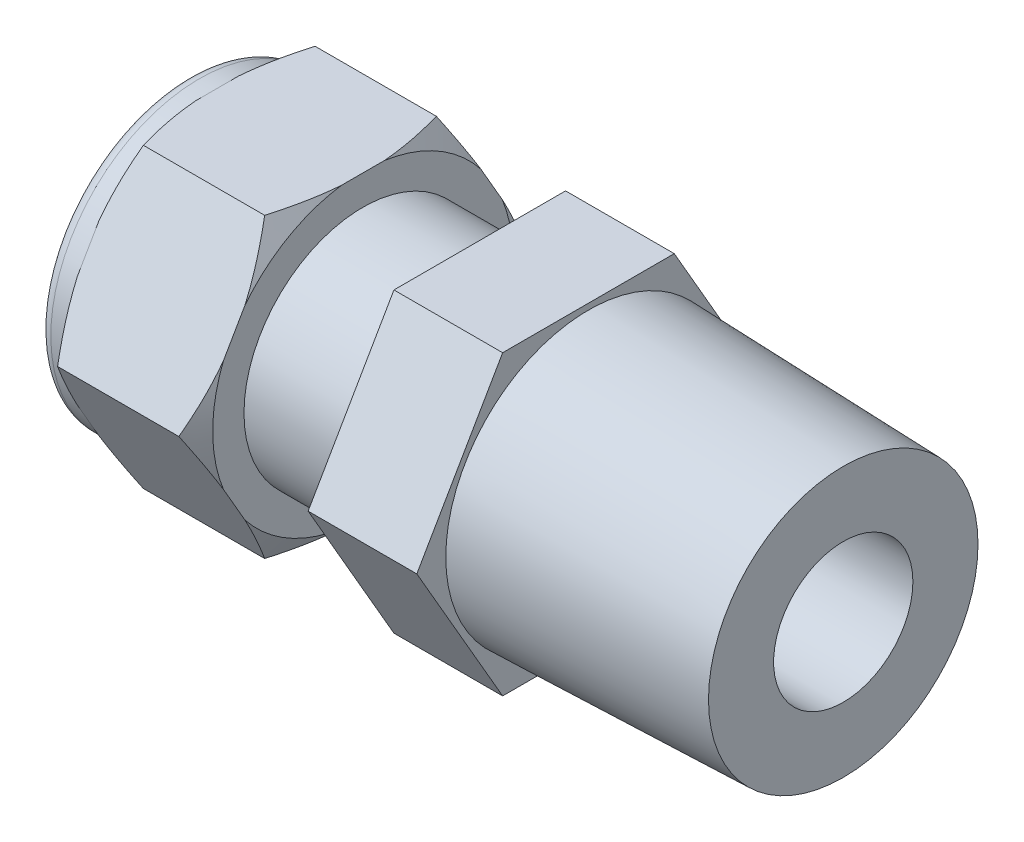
from build123d import *

# Parameters (mm, degrees)
HEX1_DEPTH         = 5.461
HEX2_DEPTH         = 8.128
BODYFILLET_R       = 0.889
DSCH_R             = 6.35
CUT_EXTRUDED_DEPTH = 22.86
SKETCH_E_R         = 5.207
CUT_EXTRUDEE_DEPTH = 26.162


with BuildPart() as part:
    # BodySch → Body (revolve)
    with BuildSketch(Plane.XY, mode=Mode.PRIVATE) as body_sk:
        Polygon((-49.022, 0), (-49.022, 11.1125), (-41.3766, 11.1125), (-41.3766, 8.89), (-27.178, 8.89), (-27.178, 10.668), (-19.05, 10.668), (0, 10.074876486), (0, 0), align=None)
    revolve(body_sk.sketch.rotate(Axis((-103.68469285, 0, 0), (1, 0, 0)), 90), axis=Axis((-103.68469285, 0, 0), (1, 0, 0)))

    # Hex1Sch_G → Hex1 (add, symmetric)
    with BuildSketch(Plane(origin=(-41.3766, 0, 0), x_dir=(0, 0, -1), z_dir=(1, 0, 0))):
        Polygon((12.831609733, 0), (6.415804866, 11.1125), (-6.415804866, 11.1125), (-12.831609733, 0), (-6.415804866, -11.1125), (6.415804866, -11.1125), align=None)
    extrude(amount=HEX1_DEPTH, both=True)

    # Hex2Sch_F → Hex2 (add)
    with BuildSketch(Plane.ZY.offset(27.178)):
        Polygon((12.831609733, 0), (6.415804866, 11.1125), (-6.415804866, 11.1125), (-12.831609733, 0), (-6.415804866, -11.1125), (6.415804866, -11.1125), align=None)
    extrude(amount=-HEX2_DEPTH)

    # BodyFillet
    bodyfillet_edges = [part.edges().sort_by_distance(p)[0] for p in [
        (-49.022, 0, -11.1125),
    ]]
    fillet(bodyfillet_edges, radius=BODYFILLET_R)

    # HexfilletSch → Hexfillet (revolve, cut)
    with BuildSketch(Plane(origin=(0, 0, 0), x_dir=(1, 0, 0), z_dir=(0, 1, 0)), mode=Mode.PRIVATE) as hexfillet_sk:
        Polygon((-46.8376, 11.227658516), (-45.911558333, 12.831609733), (-46.8376, 12.831609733), align=None)
        Polygon((-35.9156, 11.227658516), (-36.841641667, 12.831609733), (-35.9156, 12.831609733), align=None)
    revolve(hexfillet_sk.sketch.rotate(Axis((-41.994761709, 0, 0), (1, 0, 0)), 150), axis=Axis((-41.994761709, 0, 0), (1, 0, 0)), mode=Mode.SUBTRACT)

    # DSch → Cut-ExtrudeD (cut)
    with BuildSketch(Plane(origin=(-49.022, 0, 0), x_dir=(0, 0, -1), z_dir=(1, 0, 0))):
        Circle(DSCH_R)
    extrude(amount=CUT_EXTRUDED_DEPTH, mode=Mode.SUBTRACT)

    # Sketch E → Cut-ExtrudeE (cut)
    with BuildSketch(Plane(origin=(0, 0, 0), x_dir=(0, 0, -1), z_dir=(1, 0, 0))):
        Circle(SKETCH_E_R)
    extrude(amount=-CUT_EXTRUDEE_DEPTH, mode=Mode.SUBTRACT)


solid = part.part
